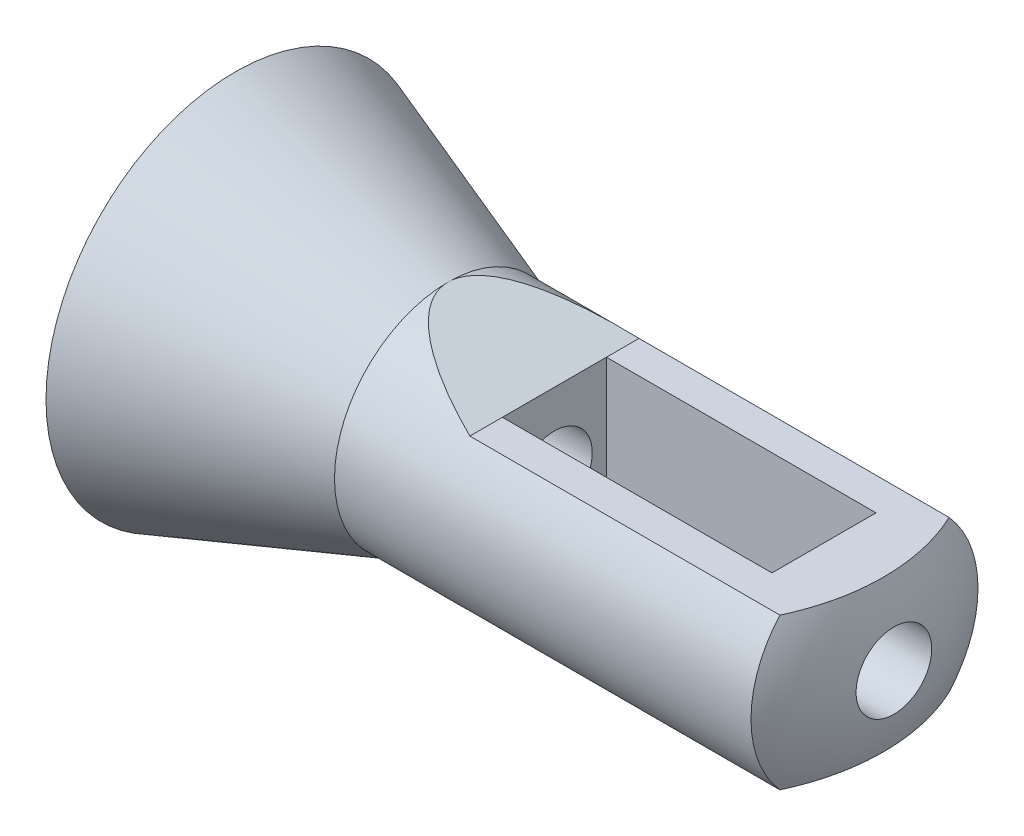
from build123d import *

# Parameters (mm, degrees)
CUT_EXTRUDE1_DEPTH = 151.996688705
SKETCH4_W          = 57
SKETCH4_H          = 22
CUT_EXTRUDE2_DEPTH = 156.357021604


with BuildPart() as part:
    # Sketch1 → Revolve1 (revolve)
    with BuildSketch(Plane(origin=(0, 0, 0), x_dir=(1, 0, 0), z_dir=(0, 1, 0)), mode=Mode.PRIVATE) as revolve1_sk:
        with BuildLine():
            Line((0, 0), (0, 40))
            Line((0, 40), (45, 24))
            Line((45, 24), (133.065732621, 24))
            ThreePointArc((133.065732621, 24), (138.23168958, 12.490837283), (140, 0))
            Line((140, 0), (0, 0))
        make_face()
    revolve(revolve1_sk.sketch.rotate(Axis((0, 0, 0), (1, 0, 0)), 180), axis=Axis((0, 0, 0), (1, 0, 0)))

    # Sketch2 → Cut-Extrude1 (cut, symmetric)
    with BuildSketch(Plane.XY):
        Polygon((469.549791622, 16), (137.05948169, 16), (67.5, 16), (0, 40), (-313.277254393, 151.387468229), (-199.953261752, 806.640776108), (582.873784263, 671.253307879), align=None)
    cut_extrude1 = extrude(amount=CUT_EXTRUDE1_DEPTH, both=True, mode=Mode.SUBTRACT)

    # Mirror1: Cut-Extrude1 across plane
    add(cut_extrude1.mirror(Plane.ZX), mode=Mode.SUBTRACT)

    # Sketch3 → Cut-Revolve2 (revolve, cut)
    with BuildSketch(Plane(origin=(0, 0, 0), x_dir=(1, 0, 0), z_dir=(0, 1, 0)), mode=Mode.PRIVATE) as cut_revolve2_sk:
        Polygon((0, 23.01873218), (0, 0), (140, 0), (140, 8), (42.240184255, 8), align=None)
    revolve(cut_revolve2_sk.sketch.rotate(Axis((0, 0, 0), (1, 0, 0)), 180), axis=Axis((0, 0, 0), (1, 0, 0)), mode=Mode.SUBTRACT)

    # Sketch4 → Cut-Extrude2 (cut, through all)
    with BuildSketch(Plane(origin=(0, 16, 0), x_dir=(1, 0, 0), z_dir=(0, 1, 0))):
        with Locations((96, 0)):
            Rectangle(SKETCH4_W, SKETCH4_H)
    extrude(amount=-CUT_EXTRUDE2_DEPTH, mode=Mode.SUBTRACT)


solid = part.part
